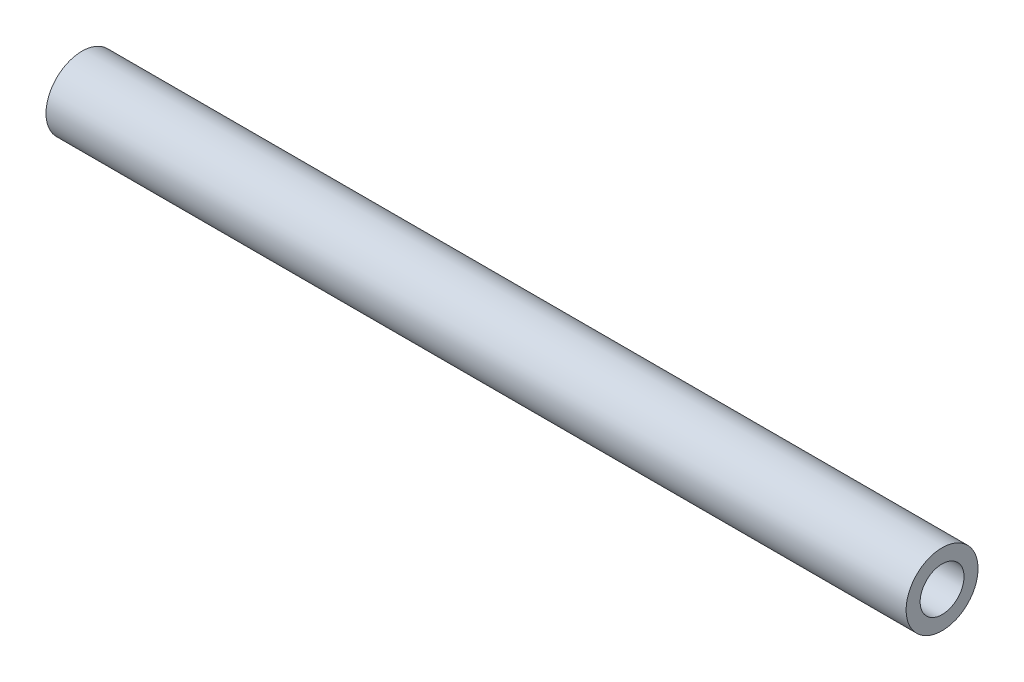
from build123d import *

# Parameters (mm, degrees)
SKETCH1_R           = 5
SKETCH1_R_2         = 3.05
BOSS_EXTRUDE1_DEPTH = 119.5


with BuildPart() as part:
    # Sketch1 → Boss-Extrude1 (new body)
    with BuildSketch(Plane(origin=(0, 0, 0), x_dir=(0, 0, -1), z_dir=(1, 0, 0))):
        with Locations(Location((0, 0, 0), (0, 0, 180))):
            Circle(SKETCH1_R)
        with Locations(Location((0, 0, 0), (0, 0, 180))):
            Circle(SKETCH1_R_2, mode=Mode.SUBTRACT)
    extrude(amount=BOSS_EXTRUDE1_DEPTH)


solid = part.part
